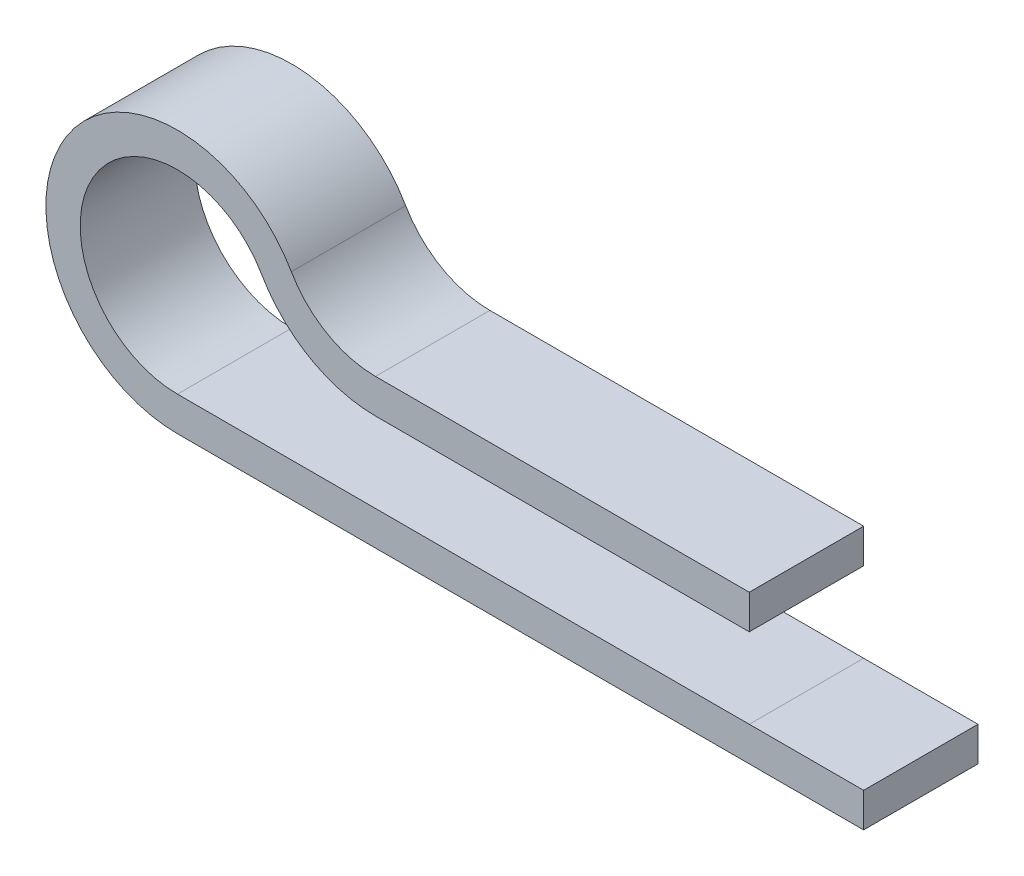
from build123d import *

# Parameters (mm, degrees)
SKETCH2_W = 5
SKETCH2_H = 1.5


with BuildPart() as part:
    # Base-Sweep: sweep along a path in Sketch1
    with BuildLine(Plane.XY) as base_sweep_path:
        Line((30, 0), (0, 0))
        ThreePointArc((0, 0), (-4.330127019, 7.5), (4.330127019, 7.5))
        ThreePointArc((4.330127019, 7.5), (6.160254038, 5.669872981), (8.660254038, 5))
        Line((8.660254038, 5), (25, 5))
    # Sketch2 → Base-Sweep (sweep)
    with BuildSketch(Plane(origin=(30, 0, 0), x_dir=(0, 0, -1), z_dir=(1, 0, 0))):
        Rectangle(SKETCH2_W, SKETCH2_H)
    sweep(path=base_sweep_path.line)


solid = part.part
